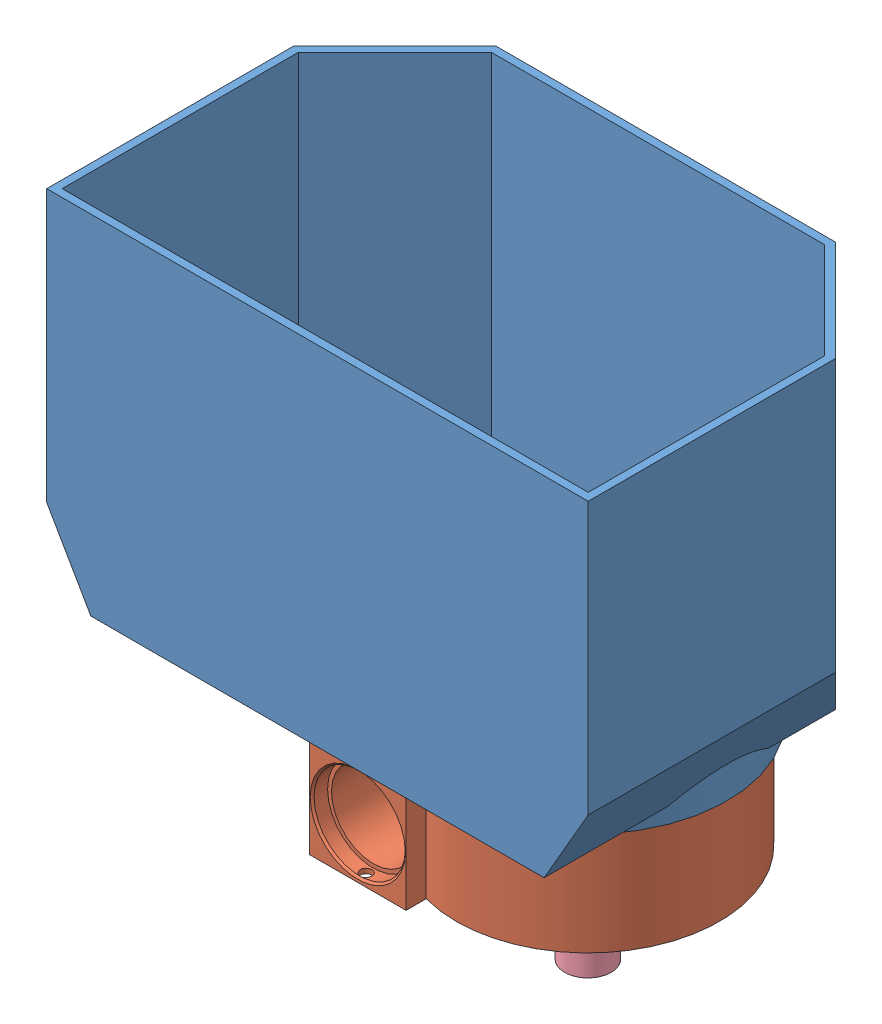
SolidWorks assembly dadancang.SLDASM, configuration 默认 (file format 11000). Lengths in mm.
Overall size (280 298.8 180).
8 component instances, 7 part files, 19 mates.
Components (placement in the parent):
- dadancang-1: dadancang.SLDPRT [默认] at origin size (280 188 180)
- dancang2-1: dancang2.SLDPRT [默认] at (50.1205 -204 90.3) size (146 72.4 144)
- zhou-1: zhou.SLDPRT [默认] at (50.1205 -191 90.3) x (0.997921 0 0.064442) z (-0.064442 0 0.997921) size (84.11 60.12 84.11)
- dianji-1: dianji.SLDPRT [默认] at (50.1205 -258.8 90.3) x (-0.997921 0 -0.064442) z (0.064442 0 -0.997921) size (24 71.8 24)
- 00压弹-1: 00压弹.SLDPRT [默认] at (57.1205 -155.5 90.3) x (1 0 0) z (0 1 0) size (39.84 38.5 4)
- 轴承3×7×2-1: 轴承3×7×2.SLDPRT [默认] at (-11.8795 -153.5 90.3) x (0 0.729139 0.684365) z (1 0 0) size (7 7 2)
- 轴承3×7×2-2: 轴承3×7×2.SLDPRT [默认] at (-9.8795 -153.5 90.3) x (0 0.64814 0.761521) z (1 0 0) size (7 7 2)
- huadan-1: huadan.SLDPRT [默认] at (50.1205 -141 90.3) x (0.554769 0 -0.832004) z (0.832004 0 0.554769) size (36 21 36)
Mates (geometry in assembly coordinates):
- 同心1: concentric: cylinder of assembly; cylinder of assembly; cylinder of dadancang-1 through (50.1205 140.002 90.3) axis (0 -1 0) radius 68; cylinder of dancang2-1 through (50.1205 -200 90.3) axis (0 -1 0) radius 68
- 平行1: parallel: plane of assembly; plane of assembly; plane of dadancang-1 through (0 0 180) normal (0 0 1); plane of dancang2-1 through (50.1205 -204 166.3) normal (0 0 1)
- 同心2: concentric: cylinder of assembly; cylinder of assembly; cylinder of dancang2-1 through (50.1205 -204 90.3) axis (0 1 0) radius 6.6; cylinder of zhou-1 through (50.1205 -203.5 90.3) axis (0 1 0) radius 6
- 平行2: parallel: plane of assembly; plane of assembly; plane of dancang2-1 through (50.1205 -200 90.3) normal (0 1 0); plane of zhou-1 through (50.1205 -141 90.3) normal (0 1 0)
- 同心20: concentric: cylinder of assembly; cylinder of assembly; cylinder of zhou-1 through (51.0614 -196 75.7303) axis (-0.064442 0 0.997921) radius 1.6; cylinder of dianji-1 through (50.8938 -196 78.3249) axis (-0.064442 0 0.997921) radius 1.5
- 同心21: concentric: cylinder of assembly; cylinder of assembly; cylinder of zhou-1 through (50.1205 -203.5 90.3) axis (0 1 0) radius 3.1; cylinder of dianji-1 through (50.1205 -258.8 90.3) axis (0 -1 0) radius 3
- 同心24: concentric: circle of assembly; circle of assembly; circle of dancang2-1; circle of dianji-1
- 重合7: coincident: plane of assembly; plane of assembly; plane of dancang2-1 through (50.1205 -204 90.3) normal (0 -1 0); plane of dianji-1 through (50.1205 -204 90.3) normal (0 1 0)
- 同心25: concentric: cylinder of assembly; cylinder of assembly; cylinder of dancang2-1 through (-22.8795 -204.001 127.8) axis (0 1 0) radius 2.5; cylinder of 00压弹-1 through (-22.8795 -155.5 127.8) axis (0 1 0) radius 1.6
- 同心26: concentric: cylinder of assembly; cylinder of assembly; cylinder of dancang2-1 through (-22.8795 -204.001 112.8) axis (0 1 0) radius 2.4198; cylinder of 00压弹-1 through (-22.8795 -155.5 112.8) axis (0 1 0) radius 1.6
- 重合8: coincident: plane of assembly; plane of assembly; plane of dancang2-1 through (-27.8795 -155.5 96.3) normal (0 1 0); plane of 00压弹-1 through (57.1205 -155.5 90.3) normal (0 -1 0)
- 同心27: concentric: cylinder of assembly; cylinder of assembly; cylinder of 轴承3×7×2-1 through (-9.8795 -153.5 90.3) axis (-1 0 0) radius 1.5; cylinder of 轴承3×7×2-2 through (-7.8795 -153.5 90.3) axis (-1 0 0) radius 1.5
- 距离1: distance: plane of assembly; plane of assembly; plane of 轴承3×7×2-1 through (-9.8795 -153.5 90.3) normal (1 0 0); plane of 轴承3×7×2-2 through (-9.8795 -153.5 90.3) normal (-1 0 0)
- 同心28: concentric: cylinder of assembly; cylinder of assembly; cylinder of dancang2-1 through (118.1215 -153.5 90.3) axis (-1 0 0) radius 1.5; cylinder of 轴承3×7×2-1 through (-9.8795 -153.5 90.3) axis (-1 0 0) radius 1.5
- 距离2: distance: plane of assembly; plane of assembly; plane of dancang2-1 through (-11.8795 -153.5 90.3) normal (1 0 0); plane of 轴承3×7×2-1 through (-11.8795 -153.5 90.3) normal (-1 0 0)
- 重合11: coincident: plane of assembly; plane of assembly; plane of dadancang-1 through (50.1205 -148 90.3) normal (0 -1 0); plane of dancang2-1 through (-12.8795 -148 90.3) normal (0 1 0)
- 同心29: concentric: cylinder of zhou-1 through (50.9583 -151 77.327) axis (0 1 0) radius 1.55; cylinder of ? through (50.9583 189.1607 77.327) axis (0 1 0) radius 1.5
- 同心30: concentric: cylinder of assembly; cylinder of assembly; cylinder of zhou-1 through (38.4667 -151 96.061) axis (0 1 0) radius 1.55; cylinder of huadan-1 through (38.4667 -146 96.061) axis (0 1 0) radius 1.5
- 重合13: coincident: plane of assembly; plane of assembly; plane of zhou-1 through (50.1205 -141 90.3) normal (0 1 0); plane of huadan-1 through (60.1063 -141 75.3239) normal (0 -1 0)
